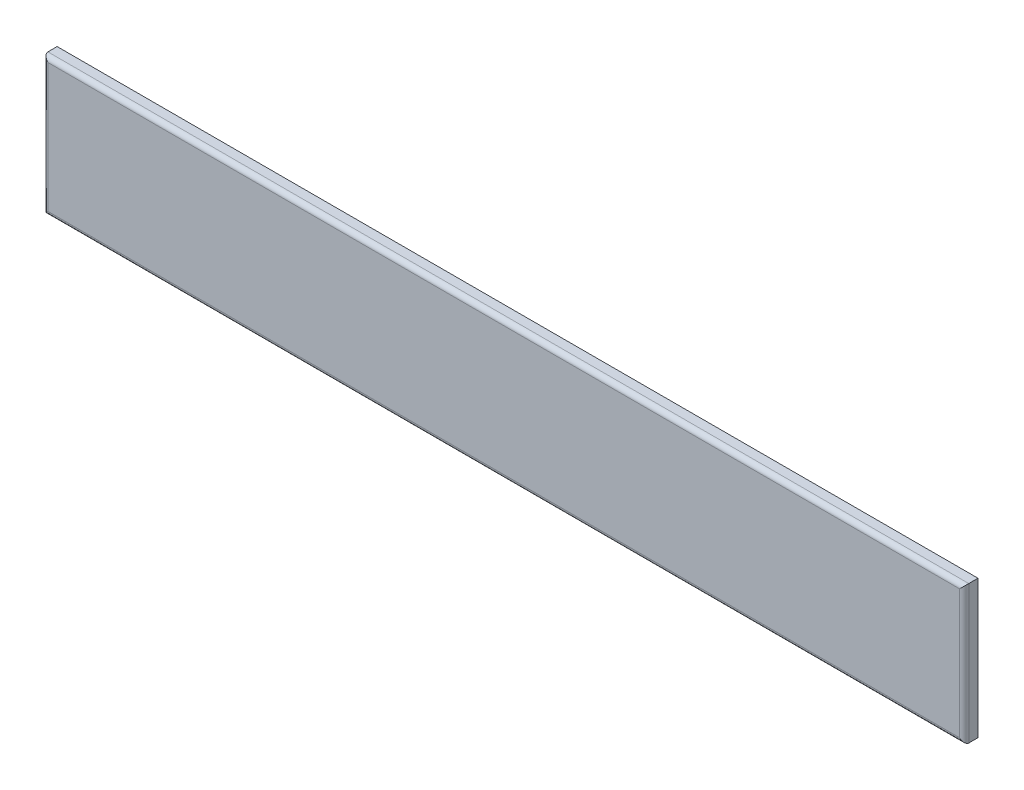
from build123d import *

# Parameters (mm, degrees)
SKETCH_1_W      = 2000
SKETCH_1_H      = 300
EXTRUDE_1_DEPTH = 30
FILLET_1_R      = 10


with BuildPart() as part:
    # Sketch 1 → Extrude 1 (new body)
    with BuildSketch(Plane.XY):
        with Locations((-1000, -150)):
            Rectangle(SKETCH_1_W, SKETCH_1_H)
    extrude(amount=EXTRUDE_1_DEPTH)

    # Fillet 1
    fillet_1_edges = [part.edges().sort_by_distance(p)[0] for p in [
        (-2000, -150, 30),
        (-1000, -300, 30),
        (0, -150, 30),
        (-1000, 0, 30),
    ]]
    fillet(fillet_1_edges, radius=FILLET_1_R)


solid = part.part
